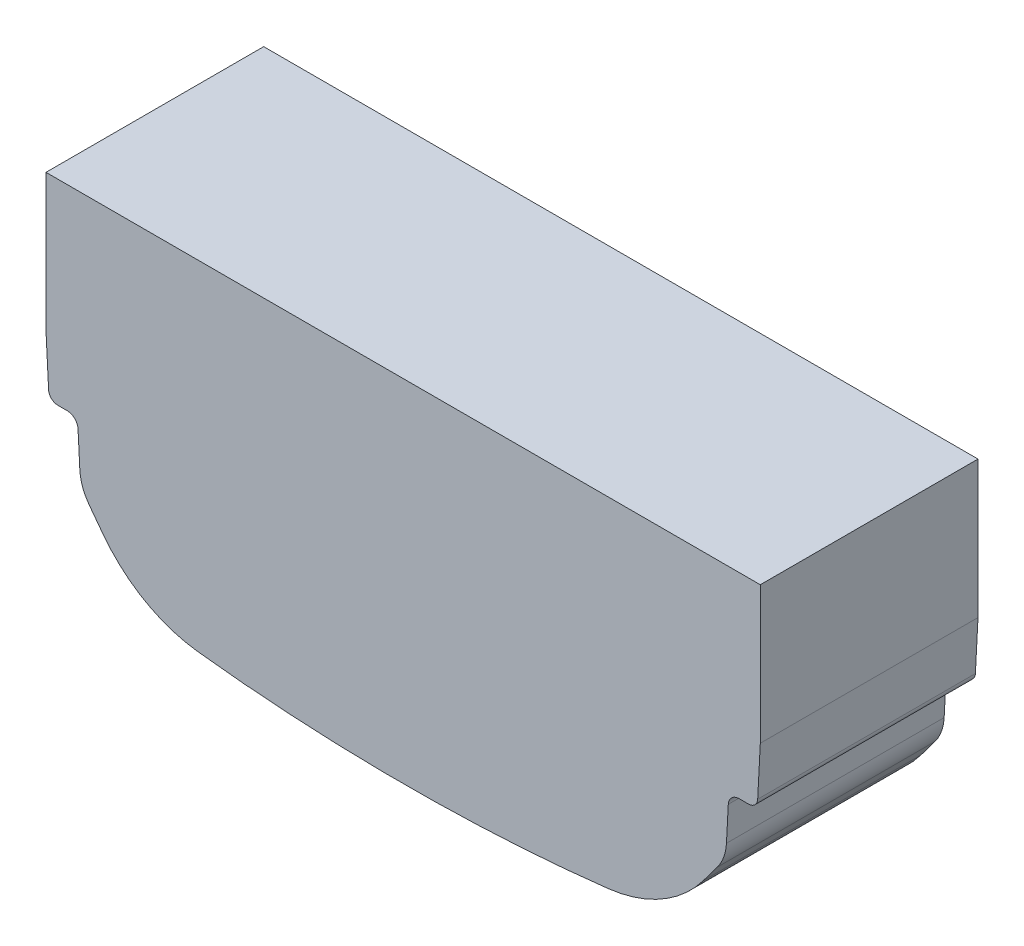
ISO-10303-21;
HEADER;
FILE_DESCRIPTION(('STEP AP214'),'2;1');
FILE_NAME('part.step','',(''),(''),'','','');
FILE_SCHEMA(('AUTOMOTIVE_DESIGN { 1 0 10303 214 1 1 1 1 }'));
ENDSEC;
DATA;
#1=APPLICATION_CONTEXT('core data for automotive mechanical design processes');
#2=APPLICATION_PROTOCOL_DEFINITION('international standard','automotive_design',2000,#1);
#3=PRODUCT_CONTEXT('',#1,'mechanical');
#4=PRODUCT('Part','Part','',(#3));
#5=PRODUCT_RELATED_PRODUCT_CATEGORY('part','',(#4));
#6=PRODUCT_DEFINITION_FORMATION('','',#4);
#7=PRODUCT_DEFINITION_CONTEXT('part definition',#1,'design');
#8=PRODUCT_DEFINITION('design','',#6,#7);
#9=PRODUCT_DEFINITION_SHAPE('','',#8);
#10=(LENGTH_UNIT() NAMED_UNIT(*) SI_UNIT(.MILLI.,.METRE.));
#11=(NAMED_UNIT(*) PLANE_ANGLE_UNIT() SI_UNIT($,.RADIAN.));
#12=(NAMED_UNIT(*) SI_UNIT($,.STERADIAN.) SOLID_ANGLE_UNIT());
#13=UNCERTAINTY_MEASURE_WITH_UNIT(LENGTH_MEASURE(1.E-05),#10,'distance_accuracy_value','');
#14=(GEOMETRIC_REPRESENTATION_CONTEXT(3) GLOBAL_UNCERTAINTY_ASSIGNED_CONTEXT((#13)) GLOBAL_UNIT_ASSIGNED_CONTEXT((#10,
#11,#12)) REPRESENTATION_CONTEXT('',''));
#15=CARTESIAN_POINT('',(0.,0.,0.));
#16=DIRECTION('',(0.,0.,1.));
#17=DIRECTION('',(1.,0.,0.));
#18=AXIS2_PLACEMENT_3D('',#15,#16,#17);
#19=CARTESIAN_POINT('',(212.453485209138,-97.6598162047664,-64.75));
#20=DIRECTION('',(1.,0.,0.));
#21=DIRECTION('',(0.,0.,-1.));
#22=AXIS2_PLACEMENT_3D('',#19,#20,#21);
#23=PLANE('',#22);
#24=DIRECTION('',(0.,1.,0.));
#25=VECTOR('',#24,1.);
#26=CARTESIAN_POINT('',(212.453485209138,-97.6598162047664,64.75));
#27=LINE('',#26,#25);
#28=CARTESIAN_POINT('',(212.453485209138,-97.6598162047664,64.75));
#29=VERTEX_POINT('',#28);
#30=CARTESIAN_POINT('',(212.453485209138,-15.9999999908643,64.75));
#31=VERTEX_POINT('',#30);
#32=EDGE_CURVE('E202',#29,#31,#27,.T.);
#33=ORIENTED_EDGE('',*,*,#32,.F.);
#34=DIRECTION('',(0.,0.,1.));
#35=VECTOR('',#34,1.);
#36=CARTESIAN_POINT('',(212.453485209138,-97.6598162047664,-64.75));
#37=LINE('',#36,#35);
#38=CARTESIAN_POINT('',(212.453485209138,-97.6598162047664,-64.75));
#39=VERTEX_POINT('',#38);
#40=EDGE_CURVE('E11',#39,#29,#37,.T.);
#41=ORIENTED_EDGE('',*,*,#40,.F.);
#42=DIRECTION('',(0.,1.,0.));
#43=VECTOR('',#42,1.);
#44=CARTESIAN_POINT('',(212.453485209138,-97.6598162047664,-64.75));
#45=LINE('',#44,#43);
#46=CARTESIAN_POINT('',(212.453485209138,-15.9999999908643,-64.75));
#47=VERTEX_POINT('',#46);
#48=EDGE_CURVE('E263',#39,#47,#45,.T.);
#49=ORIENTED_EDGE('',*,*,#48,.T.);
#50=DIRECTION('',(0.,0.,1.));
#51=VECTOR('',#50,1.);
#52=CARTESIAN_POINT('',(212.453485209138,-15.9999999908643,-64.75));
#53=LINE('',#52,#51);
#54=EDGE_CURVE('E36',#47,#31,#53,.T.);
#55=ORIENTED_EDGE('',*,*,#54,.T.);
#56=EDGE_LOOP('',(#33,#41,#49,#55));
#57=FACE_BOUND('',#56,.T.);
#58=ADVANCED_FACE('F33',(#57),#23,.T.);
#59=CARTESIAN_POINT('',(210.900745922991,-127.287847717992,-64.75));
#60=DIRECTION('',(0.998629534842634,-0.0523359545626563,0.));
#61=DIRECTION('',(0.0523359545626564,0.998629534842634,0.));
#62=AXIS2_PLACEMENT_3D('',#59,#60,#61);
#63=PLANE('',#62);
#64=DIRECTION('',(0.0523359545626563,0.998629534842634,0.));
#65=VECTOR('',#64,1.);
#66=CARTESIAN_POINT('',(210.900745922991,-127.287847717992,64.75));
#67=LINE('',#66,#65);
#68=CARTESIAN_POINT('',(210.900745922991,-127.287847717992,64.75));
#69=VERTEX_POINT('',#68);
#70=EDGE_CURVE('E261',#69,#29,#67,.T.);
#71=ORIENTED_EDGE('',*,*,#70,.F.);
#72=DIRECTION('',(0.,0.,1.));
#73=VECTOR('',#72,1.);
#74=CARTESIAN_POINT('',(210.900745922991,-127.287847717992,-64.75));
#75=LINE('',#74,#73);
#76=CARTESIAN_POINT('',(210.900745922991,-127.287847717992,-64.75));
#77=VERTEX_POINT('',#76);
#78=EDGE_CURVE('E42',#77,#69,#75,.T.);
#79=ORIENTED_EDGE('',*,*,#78,.F.);
#80=DIRECTION('',(0.0523359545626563,0.998629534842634,0.));
#81=VECTOR('',#80,1.);
#82=CARTESIAN_POINT('',(210.900745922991,-127.287847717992,-64.75));
#83=LINE('',#82,#81);
#84=EDGE_CURVE('E192',#77,#39,#83,.T.);
#85=ORIENTED_EDGE('',*,*,#84,.T.);
#86=ORIENTED_EDGE('',*,*,#40,.T.);
#87=EDGE_LOOP('',(#71,#79,#85,#86));
#88=FACE_BOUND('',#87,.T.);
#89=ADVANCED_FACE('F299',(#88),#63,.T.);
#90=CARTESIAN_POINT('',(205.408283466,-126.999999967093,-64.75));
#91=DIRECTION('',(0.,0.,1.));
#92=DIRECTION('',(1.,0.,0.));
#93=AXIS2_PLACEMENT_3D('',#90,#91,#92);
#94=CYLINDRICAL_SURFACE('',#93,5.50000001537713);
#95=CARTESIAN_POINT('',(205.408283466,-126.999999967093,64.75));
#96=DIRECTION('',(0.,0.,1.));
#97=DIRECTION('',(1.,0.,0.));
#98=AXIS2_PLACEMENT_3D('',#95,#96,#97);
#99=CIRCLE('',#98,5.50000001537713);
#100=CARTESIAN_POINT('',(205.408283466,-132.49999998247,64.75));
#101=VERTEX_POINT('',#100);
#102=EDGE_CURVE('E179',#101,#69,#99,.T.);
#103=ORIENTED_EDGE('',*,*,#102,.F.);
#104=DIRECTION('',(0.,0.,1.));
#105=VECTOR('',#104,1.);
#106=CARTESIAN_POINT('',(205.408283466,-132.49999998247,-64.75));
#107=LINE('',#106,#105);
#108=CARTESIAN_POINT('',(205.408283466,-132.49999998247,-64.75));
#109=VERTEX_POINT('',#108);
#110=EDGE_CURVE('E174',#109,#101,#107,.T.);
#111=ORIENTED_EDGE('',*,*,#110,.F.);
#112=CARTESIAN_POINT('',(205.408283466,-126.999999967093,-64.75));
#113=DIRECTION('',(0.,0.,1.));
#114=DIRECTION('',(1.,0.,0.));
#115=AXIS2_PLACEMENT_3D('',#112,#113,#114);
#116=CIRCLE('',#115,5.50000001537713);
#117=EDGE_CURVE('E177',#109,#77,#116,.T.);
#118=ORIENTED_EDGE('',*,*,#117,.T.);
#119=ORIENTED_EDGE('',*,*,#78,.T.);
#120=EDGE_LOOP('',(#103,#111,#118,#119));
#121=FACE_BOUND('',#120,.T.);
#122=ADVANCED_FACE('F176',(#121),#94,.T.);
#123=CARTESIAN_POINT('',(199.892169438,-132.49999998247,-64.75));
#124=DIRECTION('',(0.,-1.,0.));
#125=DIRECTION('',(0.,0.,-1.));
#126=AXIS2_PLACEMENT_3D('',#123,#124,#125);
#127=PLANE('',#126);
#128=DIRECTION('',(1.,0.,0.));
#129=VECTOR('',#128,1.);
#130=CARTESIAN_POINT('',(199.892169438,-132.49999998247,64.75));
#131=LINE('',#130,#129);
#132=CARTESIAN_POINT('',(199.892169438,-132.49999998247,64.75));
#133=VERTEX_POINT('',#132);
#134=EDGE_CURVE('E258',#133,#101,#131,.T.);
#135=ORIENTED_EDGE('',*,*,#134,.F.);
#136=DIRECTION('',(0.,0.,1.));
#137=VECTOR('',#136,1.);
#138=CARTESIAN_POINT('',(199.892169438,-132.49999998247,-64.75));
#139=LINE('',#138,#137);
#140=CARTESIAN_POINT('',(199.892169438,-132.49999998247,-64.75));
#141=VERTEX_POINT('',#140);
#142=EDGE_CURVE('E184',#141,#133,#139,.T.);
#143=ORIENTED_EDGE('',*,*,#142,.F.);
#144=DIRECTION('',(1.,0.,0.));
#145=VECTOR('',#144,1.);
#146=CARTESIAN_POINT('',(199.892169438,-132.49999998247,-64.75));
#147=LINE('',#146,#145);
#148=EDGE_CURVE('E190',#141,#109,#147,.T.);
#149=ORIENTED_EDGE('',*,*,#148,.T.);
#150=ORIENTED_EDGE('',*,*,#110,.T.);
#151=EDGE_LOOP('',(#135,#143,#149,#150));
#152=FACE_BOUND('',#151,.T.);
#153=ADVANCED_FACE('F194',(#152),#127,.T.);
#154=CARTESIAN_POINT('',(199.892169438,-139.000000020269,-64.75));
#155=DIRECTION('',(0.,0.,1.));
#156=DIRECTION('',(1.,0.,0.));
#157=AXIS2_PLACEMENT_3D('',#154,#155,#156);
#158=CYLINDRICAL_SURFACE('',#157,6.50000003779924);
#159=CARTESIAN_POINT('',(199.892169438,-139.000000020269,64.75));
#160=DIRECTION('',(0.,0.,-1.));
#161=DIRECTION('',(-1.,0.,0.));
#162=AXIS2_PLACEMENT_3D('',#159,#160,#161);
#163=CIRCLE('',#162,6.50000003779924);
#164=CARTESIAN_POINT('',(193.401077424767,-138.659816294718,64.75));
#165=VERTEX_POINT('',#164);
#166=EDGE_CURVE('E255',#165,#133,#163,.T.);
#167=ORIENTED_EDGE('',*,*,#166,.F.);
#168=DIRECTION('',(0.,0.,1.));
#169=VECTOR('',#168,1.);
#170=CARTESIAN_POINT('',(193.401077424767,-138.659816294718,-64.75));
#171=LINE('',#170,#169);
#172=CARTESIAN_POINT('',(193.401077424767,-138.659816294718,-64.75));
#173=VERTEX_POINT('',#172);
#174=EDGE_CURVE('E267',#173,#165,#171,.T.);
#175=ORIENTED_EDGE('',*,*,#174,.F.);
#176=CARTESIAN_POINT('',(199.892169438,-139.000000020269,-64.75));
#177=DIRECTION('',(0.,0.,-1.));
#178=DIRECTION('',(-1.,0.,0.));
#179=AXIS2_PLACEMENT_3D('',#176,#177,#178);
#180=CIRCLE('',#179,6.50000003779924);
#181=EDGE_CURVE('E195',#173,#141,#180,.T.);
#182=ORIENTED_EDGE('',*,*,#181,.T.);
#183=ORIENTED_EDGE('',*,*,#142,.T.);
#184=EDGE_LOOP('',(#167,#175,#182,#183));
#185=FACE_BOUND('',#184,.T.);
#186=ADVANCED_FACE('F312',(#185),#158,.F.);
#187=CARTESIAN_POINT('',(192.321408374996,-159.26112852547,-64.75));
#188=DIRECTION('',(0.99862953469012,-0.0523359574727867,0.));
#189=DIRECTION('',(0.0523359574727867,0.998629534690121,0.));
#190=AXIS2_PLACEMENT_3D('',#187,#188,#189);
#191=PLANE('',#190);
#192=DIRECTION('',(0.0523359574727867,0.998629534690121,0.));
#193=VECTOR('',#192,1.);
#194=CARTESIAN_POINT('',(192.321408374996,-159.26112852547,64.75));
#195=LINE('',#194,#193);
#196=CARTESIAN_POINT('',(192.321408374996,-159.26112852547,64.75));
#197=VERTEX_POINT('',#196);
#198=EDGE_CURVE('E252',#197,#165,#195,.T.);
#199=ORIENTED_EDGE('',*,*,#198,.F.);
#200=DIRECTION('',(0.,0.,1.));
#201=VECTOR('',#200,1.);
#202=CARTESIAN_POINT('',(192.321408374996,-159.26112852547,-64.75));
#203=LINE('',#202,#201);
#204=CARTESIAN_POINT('',(192.321408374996,-159.26112852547,-64.75));
#205=VERTEX_POINT('',#204);
#206=EDGE_CURVE('E269',#205,#197,#203,.T.);
#207=ORIENTED_EDGE('',*,*,#206,.F.);
#208=DIRECTION('',(0.0523359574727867,0.998629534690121,0.));
#209=VECTOR('',#208,1.);
#210=CARTESIAN_POINT('',(192.321408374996,-159.26112852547,-64.75));
#211=LINE('',#210,#209);
#212=EDGE_CURVE('E197',#205,#173,#211,.T.);
#213=ORIENTED_EDGE('',*,*,#212,.T.);
#214=ORIENTED_EDGE('',*,*,#174,.T.);
#215=EDGE_LOOP('',(#199,#207,#213,#214));
#216=FACE_BOUND('',#215,.T.);
#217=ADVANCED_FACE('F315',(#216),#191,.T.);
#218=CARTESIAN_POINT('',(164.85909621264,-157.82188969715,-64.75));
#219=DIRECTION('',(0.,0.,1.));
#220=DIRECTION('',(1.,0.,0.));
#221=AXIS2_PLACEMENT_3D('',#218,#219,#220);
#222=CYLINDRICAL_SURFACE('',#221,27.4999999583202);
#223=CARTESIAN_POINT('',(164.85909621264,-157.82188969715,64.75));
#224=DIRECTION('',(0.,0.,1.));
#225=DIRECTION('',(1.,0.,0.));
#226=AXIS2_PLACEMENT_3D('',#223,#224,#225);
#227=CIRCLE('',#226,27.4999999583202);
#228=CARTESIAN_POINT('',(186.874544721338,-174.301271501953,64.75));
#229=VERTEX_POINT('',#228);
#230=EDGE_CURVE('E249',#229,#197,#227,.T.);
#231=ORIENTED_EDGE('',*,*,#230,.F.);
#232=DIRECTION('',(0.,0.,1.));
#233=VECTOR('',#232,1.);
#234=CARTESIAN_POINT('',(186.874544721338,-174.301271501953,-64.75));
#235=LINE('',#234,#233);
#236=CARTESIAN_POINT('',(186.874544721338,-174.301271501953,-64.75));
#237=VERTEX_POINT('',#236);
#238=EDGE_CURVE('E271',#237,#229,#235,.T.);
#239=ORIENTED_EDGE('',*,*,#238,.F.);
#240=CARTESIAN_POINT('',(164.85909621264,-157.82188969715,-64.75));
#241=DIRECTION('',(0.,0.,1.));
#242=DIRECTION('',(1.,0.,0.));
#243=AXIS2_PLACEMENT_3D('',#240,#241,#242);
#244=CIRCLE('',#243,27.4999999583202);
#245=EDGE_CURVE('E357',#237,#205,#244,.T.);
#246=ORIENTED_EDGE('',*,*,#245,.T.);
#247=ORIENTED_EDGE('',*,*,#206,.T.);
#248=EDGE_LOOP('',(#231,#239,#246,#247));
#249=FACE_BOUND('',#248,.T.);
#250=ADVANCED_FACE('F319',(#249),#222,.T.);
#251=CARTESIAN_POINT('',(-3277.94074127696,2419.241801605,-64.75));
#252=DIRECTION('',(0.,0.,1.));
#253=DIRECTION('',(1.,0.,0.));
#254=AXIS2_PLACEMENT_3D('',#251,#252,#253);
#255=CYLINDRICAL_SURFACE('',#254,4327.97997201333);
#256=CARTESIAN_POINT('',(-3277.94074127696,2419.241801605,64.75));
#257=DIRECTION('',(0.,0.,1.));
#258=DIRECTION('',(1.,0.,0.));
#259=AXIS2_PLACEMENT_3D('',#256,#257,#258);
#260=CIRCLE('',#259,4327.97997201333);
#261=CARTESIAN_POINT('',(178.552225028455,-185.382357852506,64.75));
#262=VERTEX_POINT('',#261);
#263=EDGE_CURVE('E246',#262,#229,#260,.T.);
#264=ORIENTED_EDGE('',*,*,#263,.F.);
#265=DIRECTION('',(0.,0.,1.));
#266=VECTOR('',#265,1.);
#267=CARTESIAN_POINT('',(178.552225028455,-185.382357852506,-64.75));
#268=LINE('',#267,#266);
#269=CARTESIAN_POINT('',(178.552225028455,-185.382357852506,-64.75));
#270=VERTEX_POINT('',#269);
#271=EDGE_CURVE('E273',#270,#262,#268,.T.);
#272=ORIENTED_EDGE('',*,*,#271,.F.);
#273=CARTESIAN_POINT('',(-3277.94074127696,2419.241801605,-64.75));
#274=DIRECTION('',(0.,0.,1.));
#275=DIRECTION('',(1.,0.,0.));
#276=AXIS2_PLACEMENT_3D('',#273,#274,#275);
#277=CIRCLE('',#276,4327.97997201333);
#278=EDGE_CURVE('E354',#270,#237,#277,.T.);
#279=ORIENTED_EDGE('',*,*,#278,.T.);
#280=ORIENTED_EDGE('',*,*,#238,.T.);
#281=EDGE_LOOP('',(#264,#272,#279,#280));
#282=FACE_BOUND('',#281,.T.);
#283=ADVANCED_FACE('F323',(#282),#255,.T.);
#284=CARTESIAN_POINT('',(112.49999994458,-135.609011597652,-64.75));
#285=DIRECTION('',(0.,0.,1.));
#286=DIRECTION('',(1.,0.,0.));
#287=AXIS2_PLACEMENT_3D('',#284,#285,#286);
#288=CYLINDRICAL_SURFACE('',#287,82.7059999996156);
#289=CARTESIAN_POINT('',(112.49999994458,-135.609011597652,64.75));
#290=DIRECTION('',(0.,0.,1.));
#291=DIRECTION('',(1.,0.,0.));
#292=AXIS2_PLACEMENT_3D('',#289,#290,#291);
#293=CIRCLE('',#292,82.7059999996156);
#294=CARTESIAN_POINT('',(122.213388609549,-217.742637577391,64.75));
#295=VERTEX_POINT('',#294);
#296=EDGE_CURVE('E240',#295,#262,#293,.T.);
#297=ORIENTED_EDGE('',*,*,#296,.F.);
#298=DIRECTION('',(0.,0.,1.));
#299=VECTOR('',#298,1.);
#300=CARTESIAN_POINT('',(122.213388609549,-217.742637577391,-64.75));
#301=LINE('',#300,#299);
#302=CARTESIAN_POINT('',(122.213388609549,-217.742637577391,-64.75));
#303=VERTEX_POINT('',#302);
#304=EDGE_CURVE('E275',#303,#295,#301,.T.);
#305=ORIENTED_EDGE('',*,*,#304,.F.);
#306=CARTESIAN_POINT('',(112.49999994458,-135.609011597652,-64.75));
#307=DIRECTION('',(0.,0.,1.));
#308=DIRECTION('',(1.,0.,0.));
#309=AXIS2_PLACEMENT_3D('',#306,#307,#308);
#310=CIRCLE('',#309,82.7059999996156);
#311=EDGE_CURVE('E346',#303,#270,#310,.T.);
#312=ORIENTED_EDGE('',*,*,#311,.T.);
#313=ORIENTED_EDGE('',*,*,#271,.T.);
#314=EDGE_LOOP('',(#297,#305,#312,#313));
#315=FACE_BOUND('',#314,.T.);
#316=ADVANCED_FACE('F327',(#315),#288,.T.);
#317=CARTESIAN_POINT('',(-122.213388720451,-217.742637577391,-64.75));
#318=CARTESIAN_POINT('',(-101.945891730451,-220.139537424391,-64.75));
#319=CARTESIAN_POINT('',(-61.2500979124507,-223.588844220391,-64.75));
#320=CARTESIAN_POINT('',(0.0112681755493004,-225.264906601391,-64.75));
#321=CARTESIAN_POINT('',(61.2697439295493,-223.587529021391,-64.75));
#322=CARTESIAN_POINT('',(101.951389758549,-220.138887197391,-64.75));
#323=CARTESIAN_POINT('',(122.213388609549,-217.742637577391,-64.75));
#324=B_SPLINE_CURVE_WITH_KNOTS('',3,(#317,#318,#319,#320,#321,#322,#323),.UNSPECIFIED.,.F.,.F.,
(4,1,1,1,4),(0.,0.25,0.5,0.75,1.),.UNSPECIFIED.);
#325=DIRECTION('',(0.,0.,1.));
#326=VECTOR('',#325,1.);
#327=SURFACE_OF_LINEAR_EXTRUSION('',#324,#326);
#328=CARTESIAN_POINT('',(-122.213388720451,-217.742637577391,64.75));
#329=CARTESIAN_POINT('',(-101.945891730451,-220.139537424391,64.75));
#330=CARTESIAN_POINT('',(-61.2500979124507,-223.588844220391,64.75));
#331=CARTESIAN_POINT('',(0.0112681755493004,-225.264906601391,64.75));
#332=CARTESIAN_POINT('',(61.2697439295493,-223.587529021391,64.75));
#333=CARTESIAN_POINT('',(101.951389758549,-220.138887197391,64.75));
#334=CARTESIAN_POINT('',(122.213388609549,-217.742637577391,64.75));
#335=B_SPLINE_CURVE_WITH_KNOTS('',3,(#328,#329,#330,#331,#332,#333,#334),.UNSPECIFIED.,.F.,.F.,
(4,1,1,1,4),(0.,0.25,0.5,0.75,1.),.UNSPECIFIED.);
#336=CARTESIAN_POINT('',(-122.21338872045,-217.742637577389,64.75));
#337=VERTEX_POINT('',#336);
#338=EDGE_CURVE('E235',#337,#295,#335,.T.);
#339=ORIENTED_EDGE('',*,*,#338,.F.);
#340=DIRECTION('',(0.,0.,1.));
#341=VECTOR('',#340,1.);
#342=CARTESIAN_POINT('',(-122.21338872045,-217.742637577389,-64.75));
#343=LINE('',#342,#341);
#344=CARTESIAN_POINT('',(-122.21338872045,-217.742637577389,-64.75));
#345=VERTEX_POINT('',#344);
#346=EDGE_CURVE('E277',#345,#337,#343,.T.);
#347=ORIENTED_EDGE('',*,*,#346,.F.);
#348=EDGE_CURVE('E339',#345,#303,#324,.T.);
#349=ORIENTED_EDGE('',*,*,#348,.T.);
#350=ORIENTED_EDGE('',*,*,#304,.T.);
#351=EDGE_LOOP('',(#339,#347,#349,#350));
#352=FACE_BOUND('',#351,.T.);
#353=ADVANCED_FACE('F331',(#352),#327,.T.);
#354=CARTESIAN_POINT('',(-112.500000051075,-135.609011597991,-64.75));
#355=DIRECTION('',(0.,0.,1.));
#356=DIRECTION('',(1.,0.,0.));
#357=AXIS2_PLACEMENT_3D('',#354,#355,#356);
#358=CYLINDRICAL_SURFACE('',#357,82.7059999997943);
#359=CARTESIAN_POINT('',(-112.500000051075,-135.609011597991,64.75));
#360=DIRECTION('',(0.,0.,1.));
#361=DIRECTION('',(1.,0.,0.));
#362=AXIS2_PLACEMENT_3D('',#359,#360,#361);
#363=CIRCLE('',#362,82.7059999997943);
#364=CARTESIAN_POINT('',(-178.552225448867,-185.382357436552,64.75));
#365=VERTEX_POINT('',#364);
#366=EDGE_CURVE('E232',#365,#337,#363,.T.);
#367=ORIENTED_EDGE('',*,*,#366,.F.);
#368=DIRECTION('',(0.,0.,1.));
#369=VECTOR('',#368,1.);
#370=CARTESIAN_POINT('',(-178.552225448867,-185.382357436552,-64.75));
#371=LINE('',#370,#369);
#372=CARTESIAN_POINT('',(-178.552225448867,-185.382357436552,-64.75));
#373=VERTEX_POINT('',#372);
#374=EDGE_CURVE('E279',#373,#365,#371,.T.);
#375=ORIENTED_EDGE('',*,*,#374,.F.);
#376=CARTESIAN_POINT('',(-112.500000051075,-135.609011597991,-64.75));
#377=DIRECTION('',(0.,0.,1.));
#378=DIRECTION('',(1.,0.,0.));
#379=AXIS2_PLACEMENT_3D('',#376,#377,#378);
#380=CIRCLE('',#379,82.7059999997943);
#381=EDGE_CURVE('E347',#373,#345,#380,.T.);
#382=ORIENTED_EDGE('',*,*,#381,.T.);
#383=ORIENTED_EDGE('',*,*,#346,.T.);
#384=EDGE_LOOP('',(#367,#375,#382,#383));
#385=FACE_BOUND('',#384,.T.);
#386=ADVANCED_FACE('F336',(#385),#358,.T.);
#387=CARTESIAN_POINT('',(3277.94075727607,2419.24178023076,-64.75));
#388=DIRECTION('',(0.,0.,1.));
#389=DIRECTION('',(1.,0.,0.));
#390=AXIS2_PLACEMENT_3D('',#387,#388,#389);
#391=CYLINDRICAL_SURFACE('',#390,4327.97997201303);
#392=CARTESIAN_POINT('',(3277.94075727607,2419.24178023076,64.75));
#393=DIRECTION('',(0.,0.,1.));
#394=DIRECTION('',(1.,0.,0.));
#395=AXIS2_PLACEMENT_3D('',#392,#393,#394);
#396=CIRCLE('',#395,4327.97997201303);
#397=CARTESIAN_POINT('',(-186.874544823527,-174.301271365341,64.75));
#398=VERTEX_POINT('',#397);
#399=EDGE_CURVE('E229',#398,#365,#396,.T.);
#400=ORIENTED_EDGE('',*,*,#399,.F.);
#401=DIRECTION('',(0.,0.,1.));
#402=VECTOR('',#401,1.);
#403=CARTESIAN_POINT('',(-186.874544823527,-174.301271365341,-64.75));
#404=LINE('',#403,#402);
#405=CARTESIAN_POINT('',(-186.874544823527,-174.301271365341,-64.75));
#406=VERTEX_POINT('',#405);
#407=EDGE_CURVE('E281',#406,#398,#404,.T.);
#408=ORIENTED_EDGE('',*,*,#407,.F.);
#409=CARTESIAN_POINT('',(3277.94075727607,2419.24178023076,-64.75));
#410=DIRECTION('',(0.,0.,1.));
#411=DIRECTION('',(1.,0.,0.));
#412=AXIS2_PLACEMENT_3D('',#409,#410,#411);
#413=CIRCLE('',#412,4327.97997201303);
#414=EDGE_CURVE('E377',#406,#373,#413,.T.);
#415=ORIENTED_EDGE('',*,*,#414,.T.);
#416=ORIENTED_EDGE('',*,*,#374,.T.);
#417=EDGE_LOOP('',(#400,#408,#415,#416));
#418=FACE_BOUND('',#417,.T.);
#419=ADVANCED_FACE('F431',(#418),#391,.T.);
#420=CARTESIAN_POINT('',(-164.859096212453,-157.821889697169,-64.75));
#421=DIRECTION('',(0.,0.,1.));
#422=DIRECTION('',(1.,0.,0.));
#423=AXIS2_PLACEMENT_3D('',#420,#421,#422);
#424=CYLINDRICAL_SURFACE('',#423,27.4999999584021);
#425=CARTESIAN_POINT('',(-164.859096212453,-157.821889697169,64.75));
#426=DIRECTION('',(0.,0.,1.));
#427=DIRECTION('',(1.,0.,0.));
#428=AXIS2_PLACEMENT_3D('',#425,#426,#427);
#429=CIRCLE('',#428,27.4999999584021);
#430=CARTESIAN_POINT('',(-192.321408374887,-159.261128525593,64.75));
#431=VERTEX_POINT('',#430);
#432=EDGE_CURVE('E226',#431,#398,#429,.T.);
#433=ORIENTED_EDGE('',*,*,#432,.F.);
#434=DIRECTION('',(0.,0.,1.));
#435=VECTOR('',#434,1.);
#436=CARTESIAN_POINT('',(-192.321408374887,-159.261128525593,-64.75));
#437=LINE('',#436,#435);
#438=CARTESIAN_POINT('',(-192.321408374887,-159.261128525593,-64.75));
#439=VERTEX_POINT('',#438);
#440=EDGE_CURVE('E283',#439,#431,#437,.T.);
#441=ORIENTED_EDGE('',*,*,#440,.F.);
#442=CARTESIAN_POINT('',(-164.859096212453,-157.821889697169,-64.75));
#443=DIRECTION('',(0.,0.,1.));
#444=DIRECTION('',(1.,0.,0.));
#445=AXIS2_PLACEMENT_3D('',#442,#443,#444);
#446=CIRCLE('',#445,27.4999999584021);
#447=EDGE_CURVE('E378',#439,#406,#446,.T.);
#448=ORIENTED_EDGE('',*,*,#447,.T.);
#449=ORIENTED_EDGE('',*,*,#407,.T.);
#450=EDGE_LOOP('',(#433,#441,#448,#449));
#451=FACE_BOUND('',#450,.T.);
#452=ADVANCED_FACE('F429',(#451),#424,.T.);
#453=CARTESIAN_POINT('',(-193.401077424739,-138.659816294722,-64.75));
#454=DIRECTION('',(-0.998629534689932,-0.0523359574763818,0.));
#455=DIRECTION('',(0.0523359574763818,-0.998629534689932,0.));
#456=AXIS2_PLACEMENT_3D('',#453,#454,#455);
#457=PLANE('',#456);
#458=DIRECTION('',(0.0523359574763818,-0.998629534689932,0.));
#459=VECTOR('',#458,1.);
#460=CARTESIAN_POINT('',(-193.401077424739,-138.659816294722,64.75));
#461=LINE('',#460,#459);
#462=CARTESIAN_POINT('',(-193.401077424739,-138.659816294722,64.75));
#463=VERTEX_POINT('',#462);
#464=EDGE_CURVE('E223',#463,#431,#461,.T.);
#465=ORIENTED_EDGE('',*,*,#464,.F.);
#466=DIRECTION('',(0.,0.,1.));
#467=VECTOR('',#466,1.);
#468=CARTESIAN_POINT('',(-193.401077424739,-138.659816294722,-64.75));
#469=LINE('',#468,#467);
#470=CARTESIAN_POINT('',(-193.401077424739,-138.659816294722,-64.75));
#471=VERTEX_POINT('',#470);
#472=EDGE_CURVE('E285',#471,#463,#469,.T.);
#473=ORIENTED_EDGE('',*,*,#472,.F.);
#474=DIRECTION('',(0.0523359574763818,-0.998629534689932,0.));
#475=VECTOR('',#474,1.);
#476=CARTESIAN_POINT('',(-193.401077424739,-138.659816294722,-64.75));
#477=LINE('',#476,#475);
#478=EDGE_CURVE('E381',#471,#439,#477,.T.);
#479=ORIENTED_EDGE('',*,*,#478,.T.);
#480=ORIENTED_EDGE('',*,*,#440,.T.);
#481=EDGE_LOOP('',(#465,#473,#479,#480));
#482=FACE_BOUND('',#481,.T.);
#483=ADVANCED_FACE('F425',(#482),#457,.T.);
#484=CARTESIAN_POINT('',(-199.892169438,-139.000000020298,-64.75));
#485=DIRECTION('',(0.,0.,1.));
#486=DIRECTION('',(1.,0.,0.));
#487=AXIS2_PLACEMENT_3D('',#484,#485,#486);
#488=CYLINDRICAL_SURFACE('',#487,6.50000003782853);
#489=CARTESIAN_POINT('',(-199.892169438,-139.000000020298,64.75));
#490=DIRECTION('',(0.,0.,-1.));
#491=DIRECTION('',(-1.,0.,0.));
#492=AXIS2_PLACEMENT_3D('',#489,#490,#491);
#493=CIRCLE('',#492,6.50000003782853);
#494=CARTESIAN_POINT('',(-199.892169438,-132.49999998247,64.75));
#495=VERTEX_POINT('',#494);
#496=EDGE_CURVE('E220',#495,#463,#493,.T.);
#497=ORIENTED_EDGE('',*,*,#496,.F.);
#498=DIRECTION('',(0.,0.,1.));
#499=VECTOR('',#498,1.);
#500=CARTESIAN_POINT('',(-199.892169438,-132.49999998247,-64.75));
#501=LINE('',#500,#499);
#502=CARTESIAN_POINT('',(-199.892169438,-132.49999998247,-64.75));
#503=VERTEX_POINT('',#502);
#504=EDGE_CURVE('E287',#503,#495,#501,.T.);
#505=ORIENTED_EDGE('',*,*,#504,.F.);
#506=CARTESIAN_POINT('',(-199.892169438,-139.000000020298,-64.75));
#507=DIRECTION('',(0.,0.,-1.));
#508=DIRECTION('',(-1.,0.,0.));
#509=AXIS2_PLACEMENT_3D('',#506,#507,#508);
#510=CIRCLE('',#509,6.50000003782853);
#511=EDGE_CURVE('E386',#503,#471,#510,.T.);
#512=ORIENTED_EDGE('',*,*,#511,.T.);
#513=ORIENTED_EDGE('',*,*,#472,.T.);
#514=EDGE_LOOP('',(#497,#505,#512,#513));
#515=FACE_BOUND('',#514,.T.);
#516=ADVANCED_FACE('F421',(#515),#488,.F.);
#517=CARTESIAN_POINT('',(-205.408283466,-132.49999998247,-64.75));
#518=DIRECTION('',(0.,-1.,0.));
#519=DIRECTION('',(0.,0.,-1.));
#520=AXIS2_PLACEMENT_3D('',#517,#518,#519);
#521=PLANE('',#520);
#522=DIRECTION('',(1.,0.,0.));
#523=VECTOR('',#522,1.);
#524=CARTESIAN_POINT('',(-205.408283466,-132.49999998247,64.75));
#525=LINE('',#524,#523);
#526=CARTESIAN_POINT('',(-205.408283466,-132.49999998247,64.75));
#527=VERTEX_POINT('',#526);
#528=EDGE_CURVE('E217',#527,#495,#525,.T.);
#529=ORIENTED_EDGE('',*,*,#528,.F.);
#530=DIRECTION('',(0.,0.,1.));
#531=VECTOR('',#530,1.);
#532=CARTESIAN_POINT('',(-205.408283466,-132.49999998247,-64.75));
#533=LINE('',#532,#531);
#534=CARTESIAN_POINT('',(-205.408283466,-132.49999998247,-64.75));
#535=VERTEX_POINT('',#534);
#536=EDGE_CURVE('E289',#535,#527,#533,.T.);
#537=ORIENTED_EDGE('',*,*,#536,.F.);
#538=DIRECTION('',(1.,0.,0.));
#539=VECTOR('',#538,1.);
#540=CARTESIAN_POINT('',(-205.408283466,-132.49999998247,-64.75));
#541=LINE('',#540,#539);
#542=EDGE_CURVE('E389',#535,#503,#541,.T.);
#543=ORIENTED_EDGE('',*,*,#542,.T.);
#544=ORIENTED_EDGE('',*,*,#504,.T.);
#545=EDGE_LOOP('',(#529,#537,#543,#544));
#546=FACE_BOUND('',#545,.T.);
#547=ADVANCED_FACE('F417',(#546),#521,.T.);
#548=CARTESIAN_POINT('',(-205.408283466,-126.999999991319,-64.75));
#549=DIRECTION('',(0.,0.,1.));
#550=DIRECTION('',(1.,0.,0.));
#551=AXIS2_PLACEMENT_3D('',#548,#549,#550);
#552=CYLINDRICAL_SURFACE('',#551,5.49999999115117);
#553=CARTESIAN_POINT('',(-205.408283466,-126.999999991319,64.75));
#554=DIRECTION('',(0.,0.,1.));
#555=DIRECTION('',(1.,0.,0.));
#556=AXIS2_PLACEMENT_3D('',#553,#554,#555);
#557=CIRCLE('',#556,5.49999999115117);
#558=CARTESIAN_POINT('',(-210.900745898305,-127.287847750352,64.75));
#559=VERTEX_POINT('',#558);
#560=EDGE_CURVE('E214',#559,#527,#557,.T.);
#561=ORIENTED_EDGE('',*,*,#560,.F.);
#562=DIRECTION('',(0.,0.,1.));
#563=VECTOR('',#562,1.);
#564=CARTESIAN_POINT('',(-210.900745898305,-127.287847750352,-64.75));
#565=LINE('',#564,#563);
#566=CARTESIAN_POINT('',(-210.900745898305,-127.287847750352,-64.75));
#567=VERTEX_POINT('',#566);
#568=EDGE_CURVE('E291',#567,#559,#565,.T.);
#569=ORIENTED_EDGE('',*,*,#568,.F.);
#570=CARTESIAN_POINT('',(-205.408283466,-126.999999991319,-64.75));
#571=DIRECTION('',(0.,0.,1.));
#572=DIRECTION('',(1.,0.,0.));
#573=AXIS2_PLACEMENT_3D('',#570,#571,#572);
#574=CIRCLE('',#573,5.49999999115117);
#575=EDGE_CURVE('E392',#567,#535,#574,.T.);
#576=ORIENTED_EDGE('',*,*,#575,.T.);
#577=ORIENTED_EDGE('',*,*,#536,.T.);
#578=EDGE_LOOP('',(#561,#569,#576,#577));
#579=FACE_BOUND('',#578,.T.);
#580=ADVANCED_FACE('F413',(#579),#552,.T.);
#581=CARTESIAN_POINT('',(-212.453485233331,-97.6598162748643,-64.75));
#582=DIRECTION('',(-0.998629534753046,-0.0523359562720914,0.));
#583=DIRECTION('',(0.0523359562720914,-0.998629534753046,0.));
#584=AXIS2_PLACEMENT_3D('',#581,#582,#583);
#585=PLANE('',#584);
#586=DIRECTION('',(0.0523359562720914,-0.998629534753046,0.));
#587=VECTOR('',#586,1.);
#588=CARTESIAN_POINT('',(-212.453485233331,-97.6598162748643,64.75));
#589=LINE('',#588,#587);
#590=CARTESIAN_POINT('',(-212.453485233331,-97.6598162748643,64.75));
#591=VERTEX_POINT('',#590);
#592=EDGE_CURVE('E211',#591,#559,#589,.T.);
#593=ORIENTED_EDGE('',*,*,#592,.F.);
#594=DIRECTION('',(0.,0.,1.));
#595=VECTOR('',#594,1.);
#596=CARTESIAN_POINT('',(-212.453485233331,-97.6598162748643,-64.75));
#597=LINE('',#596,#595);
#598=CARTESIAN_POINT('',(-212.453485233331,-97.6598162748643,-64.75));
#599=VERTEX_POINT('',#598);
#600=EDGE_CURVE('E293',#599,#591,#597,.T.);
#601=ORIENTED_EDGE('',*,*,#600,.F.);
#602=DIRECTION('',(0.0523359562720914,-0.998629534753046,0.));
#603=VECTOR('',#602,1.);
#604=CARTESIAN_POINT('',(-212.453485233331,-97.6598162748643,-64.75));
#605=LINE('',#604,#603);
#606=EDGE_CURVE('E395',#599,#567,#605,.T.);
#607=ORIENTED_EDGE('',*,*,#606,.T.);
#608=ORIENTED_EDGE('',*,*,#568,.T.);
#609=EDGE_LOOP('',(#593,#601,#607,#608));
#610=FACE_BOUND('',#609,.T.);
#611=ADVANCED_FACE('F411',(#610),#585,.T.);
#612=CARTESIAN_POINT('',(-212.453485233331,-15.9999999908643,-64.75));
#613=DIRECTION('',(-1.,0.,0.));
#614=DIRECTION('',(0.,0.,1.));
#615=AXIS2_PLACEMENT_3D('',#612,#613,#614);
#616=PLANE('',#615);
#617=DIRECTION('',(0.,-1.,0.));
#618=VECTOR('',#617,1.);
#619=CARTESIAN_POINT('',(-212.453485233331,-15.9999999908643,64.75));
#620=LINE('',#619,#618);
#621=CARTESIAN_POINT('',(-212.453485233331,-15.9999999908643,64.75));
#622=VERTEX_POINT('',#621);
#623=EDGE_CURVE('E208',#622,#591,#620,.T.);
#624=ORIENTED_EDGE('',*,*,#623,.F.);
#625=DIRECTION('',(0.,0.,1.));
#626=VECTOR('',#625,1.);
#627=CARTESIAN_POINT('',(-212.453485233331,-15.9999999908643,-64.75));
#628=LINE('',#627,#626);
#629=CARTESIAN_POINT('',(-212.453485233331,-15.9999999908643,-64.75));
#630=VERTEX_POINT('',#629);
#631=EDGE_CURVE('E294',#630,#622,#628,.T.);
#632=ORIENTED_EDGE('',*,*,#631,.F.);
#633=DIRECTION('',(0.,-1.,0.));
#634=VECTOR('',#633,1.);
#635=CARTESIAN_POINT('',(-212.453485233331,-15.9999999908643,-64.75));
#636=LINE('',#635,#634);
#637=EDGE_CURVE('E398',#630,#599,#636,.T.);
#638=ORIENTED_EDGE('',*,*,#637,.T.);
#639=ORIENTED_EDGE('',*,*,#600,.T.);
#640=EDGE_LOOP('',(#624,#632,#638,#639));
#641=FACE_BOUND('',#640,.T.);
#642=ADVANCED_FACE('F407',(#641),#616,.T.);
#643=CARTESIAN_POINT('',(212.453485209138,-15.9999999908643,-64.75));
#644=DIRECTION('',(0.,1.,0.));
#645=DIRECTION('',(-1.,0.,0.));
#646=AXIS2_PLACEMENT_3D('',#643,#644,#645);
#647=PLANE('',#646);
#648=DIRECTION('',(-1.,0.,0.));
#649=VECTOR('',#648,1.);
#650=CARTESIAN_POINT('',(212.453485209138,-15.9999999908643,64.75));
#651=LINE('',#650,#649);
#652=EDGE_CURVE('E205',#31,#622,#651,.T.);
#653=ORIENTED_EDGE('',*,*,#652,.F.);
#654=ORIENTED_EDGE('',*,*,#54,.F.);
#655=DIRECTION('',(-1.,0.,0.));
#656=VECTOR('',#655,1.);
#657=CARTESIAN_POINT('',(212.453485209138,-15.9999999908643,-64.75));
#658=LINE('',#657,#656);
#659=EDGE_CURVE('E401',#47,#630,#658,.T.);
#660=ORIENTED_EDGE('',*,*,#659,.T.);
#661=ORIENTED_EDGE('',*,*,#631,.T.);
#662=EDGE_LOOP('',(#653,#654,#660,#661));
#663=FACE_BOUND('',#662,.T.);
#664=ADVANCED_FACE('F296',(#663),#647,.T.);
#665=CARTESIAN_POINT('',(-205.408283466,-126.999999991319,-64.75));
#666=DIRECTION('',(0.,0.,1.));
#667=DIRECTION('',(1.,0.,0.));
#668=AXIS2_PLACEMENT_3D('',#665,#666,#667);
#669=PLANE('',#668);
#670=ORIENTED_EDGE('',*,*,#48,.F.);
#671=ORIENTED_EDGE('',*,*,#84,.F.);
#672=ORIENTED_EDGE('',*,*,#117,.F.);
#673=ORIENTED_EDGE('',*,*,#148,.F.);
#674=ORIENTED_EDGE('',*,*,#181,.F.);
#675=ORIENTED_EDGE('',*,*,#212,.F.);
#676=ORIENTED_EDGE('',*,*,#245,.F.);
#677=ORIENTED_EDGE('',*,*,#278,.F.);
#678=ORIENTED_EDGE('',*,*,#311,.F.);
#679=ORIENTED_EDGE('',*,*,#348,.F.);
#680=ORIENTED_EDGE('',*,*,#381,.F.);
#681=ORIENTED_EDGE('',*,*,#414,.F.);
#682=ORIENTED_EDGE('',*,*,#447,.F.);
#683=ORIENTED_EDGE('',*,*,#478,.F.);
#684=ORIENTED_EDGE('',*,*,#511,.F.);
#685=ORIENTED_EDGE('',*,*,#542,.F.);
#686=ORIENTED_EDGE('',*,*,#575,.F.);
#687=ORIENTED_EDGE('',*,*,#606,.F.);
#688=ORIENTED_EDGE('',*,*,#637,.F.);
#689=ORIENTED_EDGE('',*,*,#659,.F.);
#690=EDGE_LOOP('',(#670,#671,#672,#673,#674,#675,#676,#677,#678,#679,#680,#681,#682,#683,#684,
#685,#686,#687,#688,#689));
#691=FACE_BOUND('',#690,.T.);
#692=ADVANCED_FACE('F188',(#691),#669,.F.);
#693=CARTESIAN_POINT('',(-205.408283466,-126.999999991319,64.75));
#694=DIRECTION('',(0.,0.,1.));
#695=DIRECTION('',(1.,0.,0.));
#696=AXIS2_PLACEMENT_3D('',#693,#694,#695);
#697=PLANE('',#696);
#698=ORIENTED_EDGE('',*,*,#32,.T.);
#699=ORIENTED_EDGE('',*,*,#652,.T.);
#700=ORIENTED_EDGE('',*,*,#623,.T.);
#701=ORIENTED_EDGE('',*,*,#592,.T.);
#702=ORIENTED_EDGE('',*,*,#560,.T.);
#703=ORIENTED_EDGE('',*,*,#528,.T.);
#704=ORIENTED_EDGE('',*,*,#496,.T.);
#705=ORIENTED_EDGE('',*,*,#464,.T.);
#706=ORIENTED_EDGE('',*,*,#432,.T.);
#707=ORIENTED_EDGE('',*,*,#399,.T.);
#708=ORIENTED_EDGE('',*,*,#366,.T.);
#709=ORIENTED_EDGE('',*,*,#338,.T.);
#710=ORIENTED_EDGE('',*,*,#296,.T.);
#711=ORIENTED_EDGE('',*,*,#263,.T.);
#712=ORIENTED_EDGE('',*,*,#230,.T.);
#713=ORIENTED_EDGE('',*,*,#198,.T.);
#714=ORIENTED_EDGE('',*,*,#166,.T.);
#715=ORIENTED_EDGE('',*,*,#134,.T.);
#716=ORIENTED_EDGE('',*,*,#102,.T.);
#717=ORIENTED_EDGE('',*,*,#70,.T.);
#718=EDGE_LOOP('',(#698,#699,#700,#701,#702,#703,#704,#705,#706,#707,#708,#709,#710,#711,#712,
#713,#714,#715,#716,#717));
#719=FACE_BOUND('',#718,.T.);
#720=ADVANCED_FACE('F298',(#719),#697,.T.);
#721=CLOSED_SHELL('',(#58,#89,#122,#153,#186,#217,#250,#283,#316,#353,#386,#419,#452,#483,#516,
#547,#580,#611,#642,#664,#692,#720));
#722=MANIFOLD_SOLID_BREP('B2',#721);
#723=ADVANCED_BREP_SHAPE_REPRESENTATION('',(#18,#722),#14);
#724=SHAPE_DEFINITION_REPRESENTATION(#9,#723);
ENDSEC;
END-ISO-10303-21;
